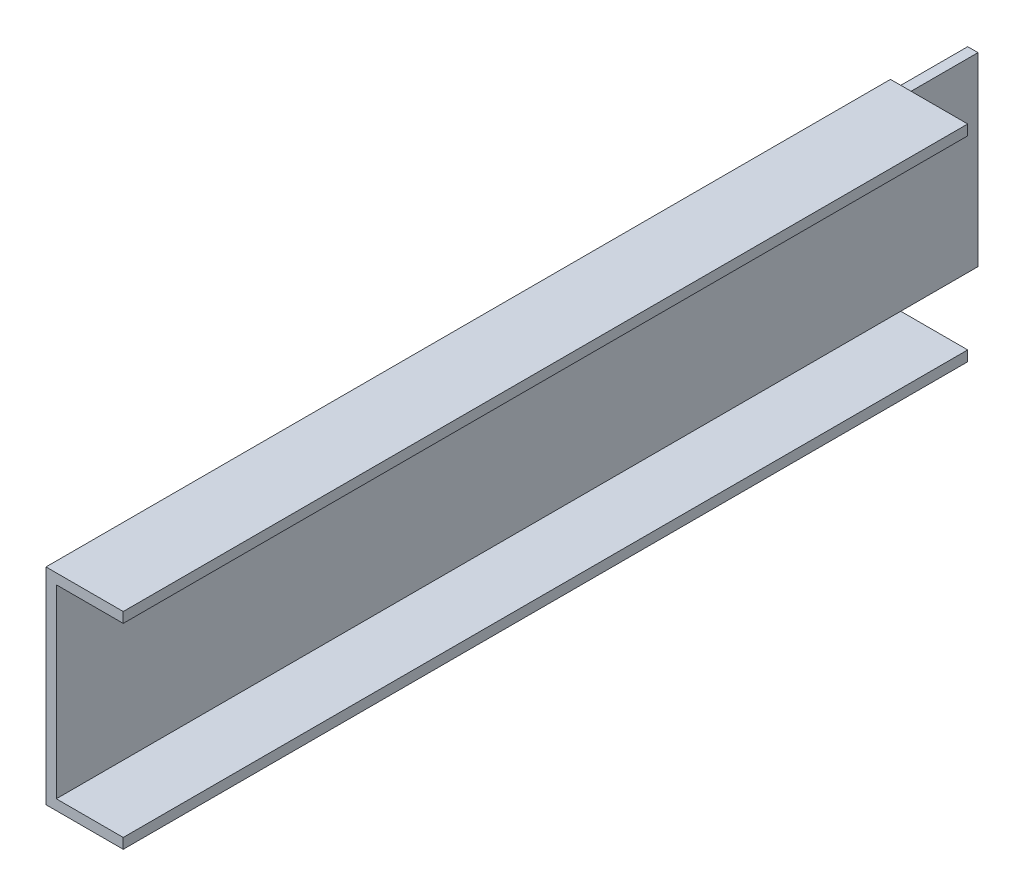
from build123d import *

# Parameters (mm, degrees)
BOSS_EXTRUDE1_DEPTH = 447.5
CUT_EXTRUDE1_REACH  = 497.864
SKETCH2_W           = 75
SKETCH2_H           = 10


with BuildPart() as part:
    # Sketch1 → Boss-Extrude1 (new, symmetric)
    with BuildSketch(Plane.XY):
        Polygon((75, 0), (0, 0), (0, 200), (75, 200), (75, 190), (10, 190), (10, 10), (75, 10), align=None)
    extrude(amount=BOSS_EXTRUDE1_DEPTH, both=True)

    # Cut-Extrude1: up to this face of the body (flat: up to its plane)
    cut_extrude1_end = Plane(part.part.faces().sort_by_distance((0, 100, 0))[0])
    # Sketch2 → Cut-Extrude1 (cut, up to the picked face)
    with BuildSketch(Plane(origin=(75, 0, 0), x_dir=(0, 0, -1), z_dir=(1, 0, 0)), mode=Mode.PRIVATE) as cut_extrude1_sk1:
        with Locations((410, 195)):
            Rectangle(SKETCH2_W, SKETCH2_H)
    cut_extrude1_tool1 = split(extrude(cut_extrude1_sk1.sketch, amount=-CUT_EXTRUDE1_REACH, mode=Mode.PRIVATE), bisect_by=cut_extrude1_end, keep=Keep.BOTH, mode=Mode.PRIVATE)
    # Sketch2 → Cut-Extrude1 (cut, up to the picked face)
    with BuildSketch(Plane(origin=(75, 0, 0), x_dir=(0, 0, -1), z_dir=(1, 0, 0)), mode=Mode.PRIVATE) as cut_extrude1_sk2:
        with Locations((410, 5)):
            Rectangle(SKETCH2_W, SKETCH2_H)
    cut_extrude1_tool2 = split(extrude(cut_extrude1_sk2.sketch, amount=-CUT_EXTRUDE1_REACH, mode=Mode.PRIVATE), bisect_by=cut_extrude1_end, keep=Keep.BOTH, mode=Mode.PRIVATE)
    add(cut_extrude1_tool1.solids().sort_by(Axis((75, 195, -410), (-1, 0, 0)))[0], mode=Mode.SUBTRACT)
    add(cut_extrude1_tool2.solids().sort_by(Axis((75, 5, -410), (-1, 0, 0)))[0], mode=Mode.SUBTRACT)


solid = part.part
